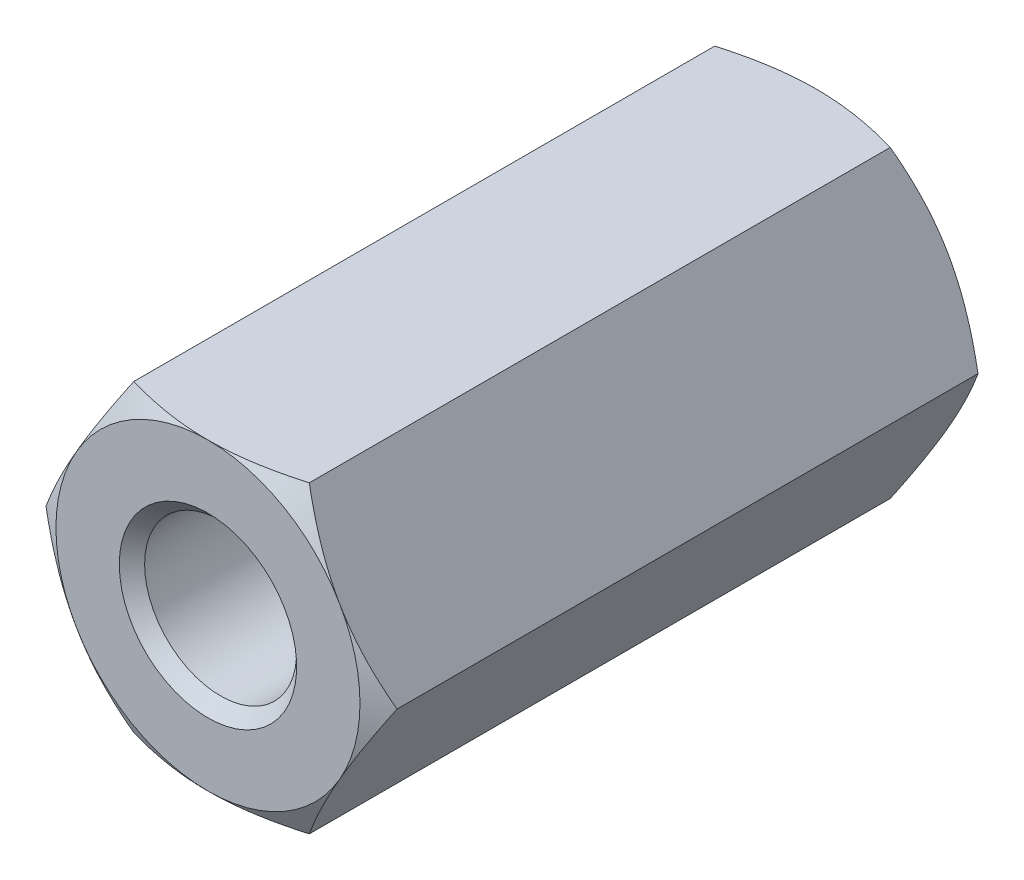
from build123d import *

# Parameters (mm, degrees)
BOSS_EXTRUDE1_DEPTH      = 6
SKETCH2_OUTSIDE_W        = 40.736
SKETCH2_OUTSIDE_H        = 39.808
SKETCH2_OUTSIDE_R        = 3
CUT_EXTRUDE1_DEPTH       = 8.549834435
CUT_EXTRUDE1_DRAFT       = -60
SKETCH3_R                = 1.5
SKETCH3_R_2              = 1.25
CUT_EXTRUDE2_DEPTH       = 6
SKETCH3_2_R              = 1.25
CUT_EXTRUDE3_DEPTH       = 6.75
CHAMFER1_SIZE            = 0.25
MIRROR1_COPY_1_SKETCH_W  = 40.736
MIRROR1_COPY_1_SKETCH_H  = 39.808
MIRROR1_COPY_1_SKETCH_R  = 3
MIRROR1_COPY_1_DEPTH     = 8.549834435
MIRROR1_COPY_1_DRAFT     = -60
CHAMFER1_OF_MIRROR1_SIZE = 0.25


with BuildPart() as part:
    # Sketch1 → Boss-Extrude1 (new body)
    with BuildSketch(Plane.XY):
        Polygon((1.732050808, 3), (-1.732050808, 3), (-3.464101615, 0), (-1.732050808, -3), (1.732050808, -3), (3.464101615, 0), align=None)
    boss_extrude1 = extrude(amount=-BOSS_EXTRUDE1_DEPTH)


with BuildPart() as cut_extrude1_tool:
    # Sketch2 outside → Cut-Extrude1 (with draft: the straight prism first)
    with BuildSketch(Plane(origin=(0, 0, -6), x_dir=(-1, 0, 0), z_dir=(0, 0, -1))):
        Rectangle(SKETCH2_OUTSIDE_W, SKETCH2_OUTSIDE_H)
        Circle(SKETCH2_OUTSIDE_R, mode=Mode.SUBTRACT)
    extrude(amount=-CUT_EXTRUDE1_DEPTH)
    # Cut-Extrude1: the draft: its side faces are tilted about the plane it starts from
    cut_extrude1_sides = [cut_extrude1_tool.faces().sort_by_distance(p)[0] for p in [
        (0, -19.904, -1.725082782),
        (-20.368, 0, -1.725082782),
        (0, 19.904, -1.725082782),
        (20.368, 0, -1.725082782),
        (3, 0, -1.725082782),
    ]]
    draft(cut_extrude1_sides, Plane(origin=(0, 0, -6), x_dir=(-1, 0, 0), z_dir=(0, 0, -1)), CUT_EXTRUDE1_DRAFT)


with BuildPart() as part_1:
    add(part.part)

    # Cut-Extrude1: cut by cut_extrude1_tool
    add(cut_extrude1_tool.part, mode=Mode.SUBTRACT)

    # Sketch3 → Cut-Extrude2 (cut)
    with BuildSketch(Plane(origin=(0, 0, -6), x_dir=(-1, 0, 0), z_dir=(0, 0, -1))):
        Circle(SKETCH3_R)
        Circle(SKETCH3_R_2, mode=Mode.SUBTRACT)
    cut_extrude2 = extrude(amount=-CUT_EXTRUDE2_DEPTH, mode=Mode.SUBTRACT)


with BuildPart() as cut_extrude2_piece_1:
    # of the separate pieces the step leaves, piece 1, a body of its own (cut_extrude2_pieces)
    add(part_1.part.solids().sort_by_distance((1.732050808, 3, 0))[0])

    # Chamfer1
    chamfer1_edges = [cut_extrude2_piece_1.edges().sort_by_distance(p)[0] for p in [
        (1.5, 0, -6),
    ]]
    chamfer(chamfer1_edges, length=CHAMFER1_SIZE)


with BuildPart() as cut_extrude2_piece_2:
    # of the separate pieces the step leaves, piece 2, a body of its own (cut_extrude2_pieces)
    add(part_1.part.solids().sort_by_distance((-1.25, 0, 0))[0])

    # Sketch3_2 → Cut-Extrude3 (cut)
    with BuildSketch(Plane(origin=(0, 0, -6), x_dir=(-1, 0, 0), z_dir=(0, 0, -1))):
        Circle(SKETCH3_2_R)
    cut_extrude3 = extrude(amount=-CUT_EXTRUDE3_DEPTH, mode=Mode.SUBTRACT)


with BuildPart() as cut_extrude2_piece_1_1:
    add(cut_extrude2_piece_1.part)

    # Mirror1: Boss-Extrude1, Cut-Extrude2, Cut-Extrude3 across plane
    add(boss_extrude1.mirror(Plane.XY))
    add(cut_extrude2.mirror(Plane.XY), mode=Mode.SUBTRACT)
    add(cut_extrude3.mirror(Plane.XY), mode=Mode.SUBTRACT)


with BuildPart() as mirror1_copy_1_tool:
    # Mirror1 copy 1 sketch → Mirror1 copy 1 (with draft: the straight prism first)
    with BuildSketch(Plane(origin=(0, 0, 6), x_dir=(-1, 0, 0), z_dir=(0, 0, 1))):
        Rectangle(MIRROR1_COPY_1_SKETCH_W, MIRROR1_COPY_1_SKETCH_H)
        Circle(MIRROR1_COPY_1_SKETCH_R, mode=Mode.SUBTRACT)
    extrude(amount=-MIRROR1_COPY_1_DEPTH)
    # Mirror1 copy 1: the draft: its side faces are tilted about the plane it starts from
    mirror1_copy_1_sides = [mirror1_copy_1_tool.faces().sort_by_distance(p)[0] for p in [
        (0, -19.904, 1.725082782),
        (-20.368, 0, 1.725082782),
        (0, 19.904, 1.725082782),
        (20.368, 0, 1.725082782),
        (3, 0, 1.725082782),
    ]]
    draft(mirror1_copy_1_sides, Plane(origin=(0, 0, 6), x_dir=(-1, 0, 0), z_dir=(0, 0, 1)), MIRROR1_COPY_1_DRAFT)


with BuildPart() as cut_extrude2_piece_1_2:
    add(cut_extrude2_piece_1_1.part)

    # Mirror1 copy 1: cut by mirror1_copy_1_tool
    add(mirror1_copy_1_tool.part, mode=Mode.SUBTRACT)

    # Chamfer1 of Mirror1
    chamfer1_of_mirror1_edges = [cut_extrude2_piece_1_2.edges().sort_by_distance(p)[0] for p in [
        (1.5, 0, 6),
    ]]
    chamfer(chamfer1_of_mirror1_edges, length=CHAMFER1_OF_MIRROR1_SIZE)


solid = cut_extrude2_piece_1_2.part
